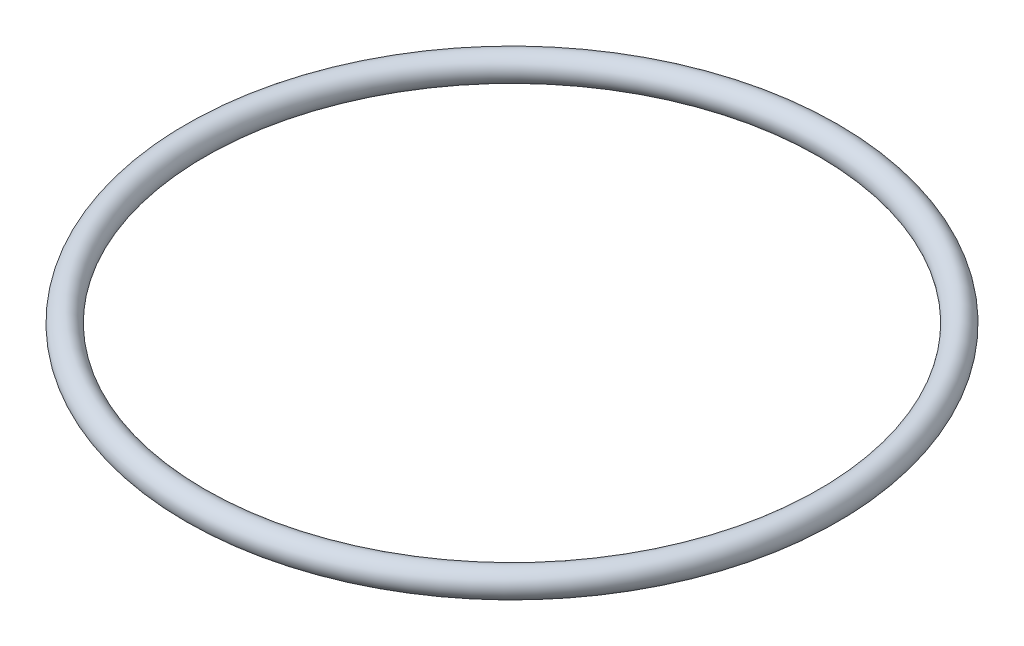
ISO-10303-21;
HEADER;
FILE_DESCRIPTION(('STEP AP214'),'2;1');
FILE_NAME('part.step','',(''),(''),'','','');
FILE_SCHEMA(('AUTOMOTIVE_DESIGN { 1 0 10303 214 1 1 1 1 }'));
ENDSEC;
DATA;
#1=APPLICATION_CONTEXT('core data for automotive mechanical design processes');
#2=APPLICATION_PROTOCOL_DEFINITION('international standard','automotive_design',2000,#1);
#3=PRODUCT_CONTEXT('',#1,'mechanical');
#4=PRODUCT('Part','Part','',(#3));
#5=PRODUCT_RELATED_PRODUCT_CATEGORY('part','',(#4));
#6=PRODUCT_DEFINITION_FORMATION('','',#4);
#7=PRODUCT_DEFINITION_CONTEXT('part definition',#1,'design');
#8=PRODUCT_DEFINITION('design','',#6,#7);
#9=PRODUCT_DEFINITION_SHAPE('','',#8);
#10=(LENGTH_UNIT() NAMED_UNIT(*) SI_UNIT(.MILLI.,.METRE.));
#11=(NAMED_UNIT(*) PLANE_ANGLE_UNIT() SI_UNIT($,.RADIAN.));
#12=(NAMED_UNIT(*) SI_UNIT($,.STERADIAN.) SOLID_ANGLE_UNIT());
#13=UNCERTAINTY_MEASURE_WITH_UNIT(LENGTH_MEASURE(1.E-05),#10,'distance_accuracy_value','');
#14=(GEOMETRIC_REPRESENTATION_CONTEXT(3) GLOBAL_UNCERTAINTY_ASSIGNED_CONTEXT((#13)) GLOBAL_UNIT_ASSIGNED_CONTEXT((#10,
#11,#12)) REPRESENTATION_CONTEXT('',''));
#15=CARTESIAN_POINT('',(0.,0.,0.));
#16=DIRECTION('',(0.,0.,1.));
#17=DIRECTION('',(1.,0.,0.));
#18=AXIS2_PLACEMENT_3D('',#15,#16,#17);
#19=CARTESIAN_POINT('',(0.,0.,0.));
#20=DIRECTION('',(0.,-1.,0.));
#21=DIRECTION('',(0.,0.,-1.));
#22=AXIS2_PLACEMENT_3D('',#19,#20,#21);
#23=TOROIDAL_SURFACE('',#22,31.3055,1.3081);
#24=CARTESIAN_POINT('',(0.,0.,-32.6136));
#25=VERTEX_POINT('',#24);
#26=VERTEX_LOOP('',#25);
#27=FACE_BOUND('',#26,.T.);
#28=ADVANCED_FACE('F38',(#27),#23,.T.);
#29=CLOSED_SHELL('',(#28));
#30=MANIFOLD_SOLID_BREP('B2',#29);
#31=ADVANCED_BREP_SHAPE_REPRESENTATION('',(#18,#30),#14);
#32=SHAPE_DEFINITION_REPRESENTATION(#9,#31);
ENDSEC;
END-ISO-10303-21;
